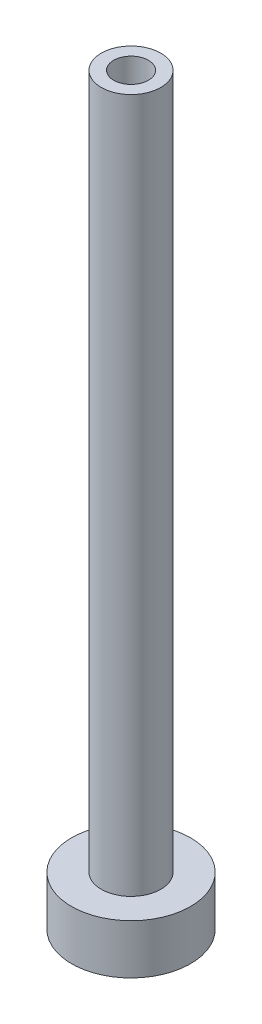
ISO-10303-21;
HEADER;
FILE_DESCRIPTION(('STEP AP214'),'2;1');
FILE_NAME('part.step','',(''),(''),'','','');
FILE_SCHEMA(('AUTOMOTIVE_DESIGN { 1 0 10303 214 1 1 1 1 }'));
ENDSEC;
DATA;
#1=APPLICATION_CONTEXT('core data for automotive mechanical design processes');
#2=APPLICATION_PROTOCOL_DEFINITION('international standard','automotive_design',2000,#1);
#3=PRODUCT_CONTEXT('',#1,'mechanical');
#4=PRODUCT('Part','Part','',(#3));
#5=PRODUCT_RELATED_PRODUCT_CATEGORY('part','',(#4));
#6=PRODUCT_DEFINITION_FORMATION('','',#4);
#7=PRODUCT_DEFINITION_CONTEXT('part definition',#1,'design');
#8=PRODUCT_DEFINITION('design','',#6,#7);
#9=PRODUCT_DEFINITION_SHAPE('','',#8);
#10=(LENGTH_UNIT() NAMED_UNIT(*) SI_UNIT(.MILLI.,.METRE.));
#11=(NAMED_UNIT(*) PLANE_ANGLE_UNIT() SI_UNIT($,.RADIAN.));
#12=(NAMED_UNIT(*) SI_UNIT($,.STERADIAN.) SOLID_ANGLE_UNIT());
#13=UNCERTAINTY_MEASURE_WITH_UNIT(LENGTH_MEASURE(1.E-05),#10,'distance_accuracy_value','');
#14=(GEOMETRIC_REPRESENTATION_CONTEXT(3) GLOBAL_UNCERTAINTY_ASSIGNED_CONTEXT((#13)) GLOBAL_UNIT_ASSIGNED_CONTEXT((#10,
#11,#12)) REPRESENTATION_CONTEXT('',''));
#15=CARTESIAN_POINT('',(0.,0.,0.));
#16=DIRECTION('',(0.,0.,1.));
#17=DIRECTION('',(1.,0.,0.));
#18=AXIS2_PLACEMENT_3D('',#15,#16,#17);
#19=CARTESIAN_POINT('',(0.,0.,0.));
#20=DIRECTION('',(0.,-1.,0.));
#21=DIRECTION('',(0.,0.,-1.));
#22=AXIS2_PLACEMENT_3D('',#19,#20,#21);
#23=CYLINDRICAL_SURFACE('',#22,6.);
#24=CARTESIAN_POINT('',(0.,-5.,0.));
#25=DIRECTION('',(0.,-1.,0.));
#26=DIRECTION('',(0.,0.,-1.));
#27=AXIS2_PLACEMENT_3D('',#24,#25,#26);
#28=CIRCLE('',#27,6.);
#29=CARTESIAN_POINT('',(0.,-5.,-6.));
#30=VERTEX_POINT('',#29);
#31=EDGE_CURVE('E41',#30,#30,#28,.T.);
#32=ORIENTED_EDGE('',*,*,#31,.F.);
#33=EDGE_LOOP('',(#32));
#34=FACE_BOUND('',#33,.T.);
#35=CARTESIAN_POINT('',(0.,0.,0.));
#36=DIRECTION('',(0.,-1.,0.));
#37=DIRECTION('',(0.,0.,-1.));
#38=AXIS2_PLACEMENT_3D('',#35,#36,#37);
#39=CIRCLE('',#38,6.);
#40=CARTESIAN_POINT('',(0.,0.,-6.));
#41=VERTEX_POINT('',#40);
#42=EDGE_CURVE('E8',#41,#41,#39,.T.);
#43=ORIENTED_EDGE('',*,*,#42,.T.);
#44=EDGE_LOOP('',(#43));
#45=FACE_BOUND('',#44,.T.);
#46=ADVANCED_FACE('F13',(#34,#45),#23,.T.);
#47=CARTESIAN_POINT('',(-6.,0.,0.));
#48=DIRECTION('',(0.,-1.,0.));
#49=DIRECTION('',(0.,0.,-1.));
#50=AXIS2_PLACEMENT_3D('',#47,#48,#49);
#51=PLANE('',#50);
#52=ORIENTED_EDGE('',*,*,#42,.F.);
#53=EDGE_LOOP('',(#52));
#54=FACE_BOUND('',#53,.T.);
#55=CARTESIAN_POINT('',(0.,0.,0.));
#56=DIRECTION('',(0.,-1.,0.));
#57=DIRECTION('',(0.,0.,-1.));
#58=AXIS2_PLACEMENT_3D('',#55,#56,#57);
#59=CIRCLE('',#58,3.);
#60=CARTESIAN_POINT('',(0.,0.,-3.));
#61=VERTEX_POINT('',#60);
#62=EDGE_CURVE('E19',#61,#61,#59,.T.);
#63=ORIENTED_EDGE('',*,*,#62,.T.);
#64=EDGE_LOOP('',(#63));
#65=FACE_BOUND('',#64,.T.);
#66=ADVANCED_FACE('F48',(#54,#65),#51,.F.);
#67=CARTESIAN_POINT('',(0.,0.,0.));
#68=DIRECTION('',(0.,-1.,0.));
#69=DIRECTION('',(0.,0.,-1.));
#70=AXIS2_PLACEMENT_3D('',#67,#68,#69);
#71=CYLINDRICAL_SURFACE('',#70,3.);
#72=ORIENTED_EDGE('',*,*,#62,.F.);
#73=EDGE_LOOP('',(#72));
#74=FACE_BOUND('',#73,.T.);
#75=CARTESIAN_POINT('',(0.,70.,0.));
#76=DIRECTION('',(0.,-1.,0.));
#77=DIRECTION('',(0.,0.,-1.));
#78=AXIS2_PLACEMENT_3D('',#75,#76,#77);
#79=CIRCLE('',#78,3.);
#80=CARTESIAN_POINT('',(0.,70.,-3.));
#81=VERTEX_POINT('',#80);
#82=EDGE_CURVE('E23',#81,#81,#79,.T.);
#83=ORIENTED_EDGE('',*,*,#82,.T.);
#84=EDGE_LOOP('',(#83));
#85=FACE_BOUND('',#84,.T.);
#86=ADVANCED_FACE('F54',(#74,#85),#71,.T.);
#87=CARTESIAN_POINT('',(-3.,70.,0.));
#88=DIRECTION('',(0.,-1.,0.));
#89=DIRECTION('',(0.,0.,-1.));
#90=AXIS2_PLACEMENT_3D('',#87,#88,#89);
#91=PLANE('',#90);
#92=ORIENTED_EDGE('',*,*,#82,.F.);
#93=EDGE_LOOP('',(#92));
#94=FACE_BOUND('',#93,.T.);
#95=CARTESIAN_POINT('',(0.,70.,0.));
#96=DIRECTION('',(0.,-1.,0.));
#97=DIRECTION('',(0.,0.,-1.));
#98=AXIS2_PLACEMENT_3D('',#95,#96,#97);
#99=CIRCLE('',#98,1.74999999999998);
#100=CARTESIAN_POINT('',(0.,70.,-1.74999999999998));
#101=VERTEX_POINT('',#100);
#102=EDGE_CURVE('E27',#101,#101,#99,.T.);
#103=ORIENTED_EDGE('',*,*,#102,.T.);
#104=EDGE_LOOP('',(#103));
#105=FACE_BOUND('',#104,.T.);
#106=ADVANCED_FACE('F60',(#94,#105),#91,.F.);
#107=CARTESIAN_POINT('',(0.,0.,0.));
#108=DIRECTION('',(0.,-1.,0.));
#109=DIRECTION('',(0.,0.,-1.));
#110=AXIS2_PLACEMENT_3D('',#107,#108,#109);
#111=CYLINDRICAL_SURFACE('',#110,1.74999999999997);
#112=ORIENTED_EDGE('',*,*,#102,.F.);
#113=EDGE_LOOP('',(#112));
#114=FACE_BOUND('',#113,.T.);
#115=CARTESIAN_POINT('',(0.,25.,0.));
#116=DIRECTION('',(0.,-1.,0.));
#117=DIRECTION('',(0.,0.,-1.));
#118=AXIS2_PLACEMENT_3D('',#115,#116,#117);
#119=CIRCLE('',#118,1.74999999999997);
#120=CARTESIAN_POINT('',(0.,25.,-1.74999999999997));
#121=VERTEX_POINT('',#120);
#122=EDGE_CURVE('E32',#121,#121,#119,.T.);
#123=ORIENTED_EDGE('',*,*,#122,.T.);
#124=EDGE_LOOP('',(#123));
#125=FACE_BOUND('',#124,.T.);
#126=ADVANCED_FACE('F66',(#114,#125),#111,.F.);
#127=CARTESIAN_POINT('',(0.,24.75,0.));
#128=DIRECTION('',(0.,-1.,0.));
#129=DIRECTION('',(0.,0.,-1.));
#130=AXIS2_PLACEMENT_3D('',#127,#128,#129);
#131=CONICAL_SURFACE('',#130,1.99999999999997,0.785398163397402);
#132=ORIENTED_EDGE('',*,*,#122,.F.);
#133=EDGE_LOOP('',(#132));
#134=FACE_BOUND('',#133,.T.);
#135=CARTESIAN_POINT('',(0.,24.75,0.));
#136=DIRECTION('',(0.,-1.,0.));
#137=DIRECTION('',(0.,0.,-1.));
#138=AXIS2_PLACEMENT_3D('',#135,#136,#137);
#139=CIRCLE('',#138,1.99999999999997);
#140=CARTESIAN_POINT('',(0.,24.75,-1.99999999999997));
#141=VERTEX_POINT('',#140);
#142=EDGE_CURVE('E35',#141,#141,#139,.T.);
#143=ORIENTED_EDGE('',*,*,#142,.T.);
#144=EDGE_LOOP('',(#143));
#145=FACE_BOUND('',#144,.T.);
#146=ADVANCED_FACE('F70',(#134,#145),#131,.F.);
#147=CARTESIAN_POINT('',(0.,0.,0.));
#148=DIRECTION('',(0.,-1.,0.));
#149=DIRECTION('',(0.,0.,-1.));
#150=AXIS2_PLACEMENT_3D('',#147,#148,#149);
#151=CYLINDRICAL_SURFACE('',#150,2.);
#152=ORIENTED_EDGE('',*,*,#142,.F.);
#153=EDGE_LOOP('',(#152));
#154=FACE_BOUND('',#153,.T.);
#155=CARTESIAN_POINT('',(0.,-5.,0.));
#156=DIRECTION('',(0.,-1.,0.));
#157=DIRECTION('',(0.,0.,-1.));
#158=AXIS2_PLACEMENT_3D('',#155,#156,#157);
#159=CIRCLE('',#158,2.);
#160=CARTESIAN_POINT('',(0.,-5.,-2.));
#161=VERTEX_POINT('',#160);
#162=EDGE_CURVE('E38',#161,#161,#159,.T.);
#163=ORIENTED_EDGE('',*,*,#162,.T.);
#164=EDGE_LOOP('',(#163));
#165=FACE_BOUND('',#164,.T.);
#166=ADVANCED_FACE('F74',(#154,#165),#151,.F.);
#167=CARTESIAN_POINT('',(-2.,-5.,0.));
#168=DIRECTION('',(0.,1.,0.));
#169=DIRECTION('',(0.,0.,1.));
#170=AXIS2_PLACEMENT_3D('',#167,#168,#169);
#171=PLANE('',#170);
#172=ORIENTED_EDGE('',*,*,#162,.F.);
#173=EDGE_LOOP('',(#172));
#174=FACE_BOUND('',#173,.T.);
#175=ORIENTED_EDGE('',*,*,#31,.T.);
#176=EDGE_LOOP('',(#175));
#177=FACE_BOUND('',#176,.T.);
#178=ADVANCED_FACE('F45',(#174,#177),#171,.F.);
#179=CLOSED_SHELL('',(#46,#66,#86,#106,#126,#146,#166,#178));
#180=MANIFOLD_SOLID_BREP('B1',#179);
#181=ADVANCED_BREP_SHAPE_REPRESENTATION('',(#18,#180),#14);
#182=SHAPE_DEFINITION_REPRESENTATION(#9,#181);
ENDSEC;
END-ISO-10303-21;
